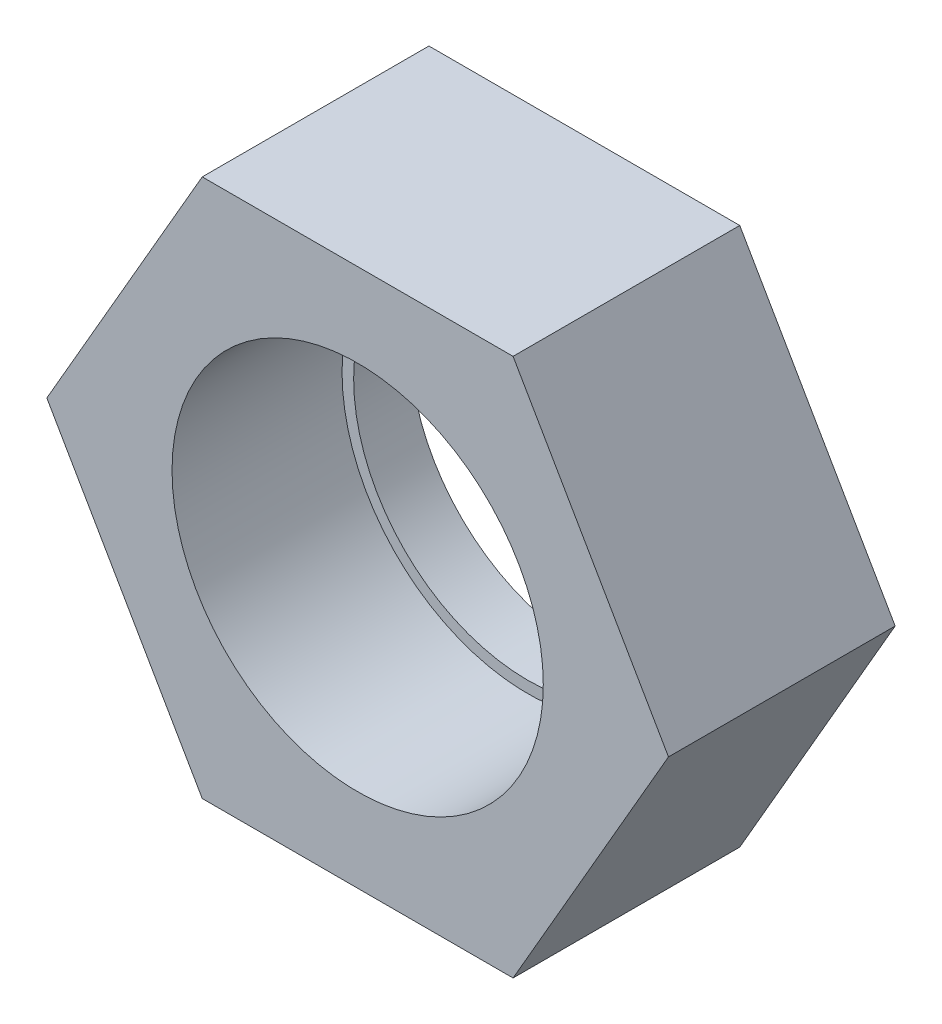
ISO-10303-21;
HEADER;
FILE_DESCRIPTION(('STEP AP214'),'2;1');
FILE_NAME('part.step','',(''),(''),'','','');
FILE_SCHEMA(('AUTOMOTIVE_DESIGN { 1 0 10303 214 1 1 1 1 }'));
ENDSEC;
DATA;
#1=APPLICATION_CONTEXT('core data for automotive mechanical design processes');
#2=APPLICATION_PROTOCOL_DEFINITION('international standard','automotive_design',2000,#1);
#3=PRODUCT_CONTEXT('',#1,'mechanical');
#4=PRODUCT('Part','Part','',(#3));
#5=PRODUCT_RELATED_PRODUCT_CATEGORY('part','',(#4));
#6=PRODUCT_DEFINITION_FORMATION('','',#4);
#7=PRODUCT_DEFINITION_CONTEXT('part definition',#1,'design');
#8=PRODUCT_DEFINITION('design','',#6,#7);
#9=PRODUCT_DEFINITION_SHAPE('','',#8);
#10=(LENGTH_UNIT() NAMED_UNIT(*) SI_UNIT(.MILLI.,.METRE.));
#11=(NAMED_UNIT(*) PLANE_ANGLE_UNIT() SI_UNIT($,.RADIAN.));
#12=(NAMED_UNIT(*) SI_UNIT($,.STERADIAN.) SOLID_ANGLE_UNIT());
#13=UNCERTAINTY_MEASURE_WITH_UNIT(LENGTH_MEASURE(1.E-05),#10,'distance_accuracy_value','');
#14=(GEOMETRIC_REPRESENTATION_CONTEXT(3) GLOBAL_UNCERTAINTY_ASSIGNED_CONTEXT((#13)) GLOBAL_UNIT_ASSIGNED_CONTEXT((#10,
#11,#12)) REPRESENTATION_CONTEXT('',''));
#15=CARTESIAN_POINT('',(0.,0.,0.));
#16=DIRECTION('',(0.,0.,1.));
#17=DIRECTION('',(1.,0.,0.));
#18=AXIS2_PLACEMENT_3D('',#15,#16,#17);
#19=CARTESIAN_POINT('',(10.4013,0.,3.175));
#20=DIRECTION('',(0.,0.,1.));
#21=DIRECTION('',(1.,0.,0.));
#22=AXIS2_PLACEMENT_3D('',#19,#20,#21);
#23=PLANE('',#22);
#24=CARTESIAN_POINT('',(0.,0.,3.175));
#25=DIRECTION('',(0.,0.,1.));
#26=DIRECTION('',(1.,0.,0.));
#27=AXIS2_PLACEMENT_3D('',#24,#25,#26);
#28=CIRCLE('',#27,9.75);
#29=CARTESIAN_POINT('',(9.75,0.,3.175));
#30=VERTEX_POINT('',#29);
#31=EDGE_CURVE('E18',#30,#30,#28,.T.);
#32=ORIENTED_EDGE('',*,*,#31,.F.);
#33=EDGE_LOOP('',(#32));
#34=FACE_BOUND('',#33,.T.);
#35=CARTESIAN_POINT('',(0.,0.,3.175));
#36=DIRECTION('',(0.,0.,1.));
#37=DIRECTION('',(1.,0.,0.));
#38=AXIS2_PLACEMENT_3D('',#35,#36,#37);
#39=CIRCLE('',#38,10.4);
#40=CARTESIAN_POINT('',(10.4,0.,3.175));
#41=VERTEX_POINT('',#40);
#42=EDGE_CURVE('E167',#41,#41,#39,.F.);
#43=ORIENTED_EDGE('',*,*,#42,.F.);
#44=EDGE_LOOP('',(#43));
#45=FACE_BOUND('',#44,.T.);
#46=ADVANCED_FACE('F14',(#34,#45),#23,.T.);
#47=CARTESIAN_POINT('',(8.70716374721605,-15.08125,12.7));
#48=DIRECTION('',(0.,0.,-1.));
#49=DIRECTION('',(-1.,0.,0.));
#50=AXIS2_PLACEMENT_3D('',#47,#48,#49);
#51=PLANE('',#50);
#52=DIRECTION('',(0.5,0.866025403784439,0.));
#53=VECTOR('',#52,1.);
#54=CARTESIAN_POINT('',(8.70716374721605,-15.08125,12.7));
#55=LINE('',#54,#53);
#56=CARTESIAN_POINT('',(8.70716374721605,-15.08125,12.7));
#57=VERTEX_POINT('',#56);
#58=CARTESIAN_POINT('',(17.4143274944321,0.,12.7));
#59=VERTEX_POINT('',#58);
#60=EDGE_CURVE('E99',#57,#59,#55,.T.);
#61=ORIENTED_EDGE('',*,*,#60,.T.);
#62=DIRECTION('',(-0.5,0.866025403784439,0.));
#63=VECTOR('',#62,1.);
#64=CARTESIAN_POINT('',(17.4143274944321,0.,12.7));
#65=LINE('',#64,#63);
#66=CARTESIAN_POINT('',(8.70716374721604,15.08125,12.7));
#67=VERTEX_POINT('',#66);
#68=EDGE_CURVE('E81',#59,#67,#65,.T.);
#69=ORIENTED_EDGE('',*,*,#68,.T.);
#70=DIRECTION('',(-1.,0.,0.));
#71=VECTOR('',#70,1.);
#72=CARTESIAN_POINT('',(8.70716374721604,15.08125,12.7));
#73=LINE('',#72,#71);
#74=CARTESIAN_POINT('',(-8.70716374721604,15.08125,12.7));
#75=VERTEX_POINT('',#74);
#76=EDGE_CURVE('E102',#67,#75,#73,.T.);
#77=ORIENTED_EDGE('',*,*,#76,.T.);
#78=DIRECTION('',(-0.5,-0.866025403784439,0.));
#79=VECTOR('',#78,1.);
#80=CARTESIAN_POINT('',(-8.70716374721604,15.08125,12.7));
#81=LINE('',#80,#79);
#82=CARTESIAN_POINT('',(-17.4143274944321,0.,12.7));
#83=VERTEX_POINT('',#82);
#84=EDGE_CURVE('E104',#75,#83,#81,.T.);
#85=ORIENTED_EDGE('',*,*,#84,.T.);
#86=DIRECTION('',(0.5,-0.866025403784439,0.));
#87=VECTOR('',#86,1.);
#88=CARTESIAN_POINT('',(-17.4143274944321,0.,12.7));
#89=LINE('',#88,#87);
#90=CARTESIAN_POINT('',(-8.70716374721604,-15.08125,12.7));
#91=VERTEX_POINT('',#90);
#92=EDGE_CURVE('E35',#83,#91,#89,.T.);
#93=ORIENTED_EDGE('',*,*,#92,.T.);
#94=DIRECTION('',(1.,0.,0.));
#95=VECTOR('',#94,1.);
#96=CARTESIAN_POINT('',(-8.70716374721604,-15.08125,12.7));
#97=LINE('',#96,#95);
#98=EDGE_CURVE('E30',#91,#57,#97,.T.);
#99=ORIENTED_EDGE('',*,*,#98,.T.);
#100=EDGE_LOOP('',(#61,#69,#77,#85,#93,#99));
#101=FACE_BOUND('',#100,.T.);
#102=CARTESIAN_POINT('',(0.,0.,12.7));
#103=DIRECTION('',(0.,0.,1.));
#104=DIRECTION('',(1.,0.,0.));
#105=AXIS2_PLACEMENT_3D('',#102,#103,#104);
#106=CIRCLE('',#105,10.4);
#107=CARTESIAN_POINT('',(10.4,0.,12.7));
#108=VERTEX_POINT('',#107);
#109=EDGE_CURVE('E169',#108,#108,#106,.T.);
#110=ORIENTED_EDGE('',*,*,#109,.F.);
#111=EDGE_LOOP('',(#110));
#112=FACE_BOUND('',#111,.T.);
#113=ADVANCED_FACE('F123',(#101,#112),#51,.F.);
#114=CARTESIAN_POINT('',(8.70716374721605,-15.08125,0.));
#115=DIRECTION('',(0.,0.,-1.));
#116=DIRECTION('',(-1.,0.,0.));
#117=AXIS2_PLACEMENT_3D('',#114,#115,#116);
#118=PLANE('',#117);
#119=CARTESIAN_POINT('',(0.,0.,0.));
#120=DIRECTION('',(0.,0.,-1.));
#121=DIRECTION('',(-1.,0.,0.));
#122=AXIS2_PLACEMENT_3D('',#119,#120,#121);
#123=CIRCLE('',#122,9.75);
#124=CARTESIAN_POINT('',(-9.75,0.,0.));
#125=VERTEX_POINT('',#124);
#126=EDGE_CURVE('E88',#125,#125,#123,.T.);
#127=ORIENTED_EDGE('',*,*,#126,.F.);
#128=EDGE_LOOP('',(#127));
#129=FACE_BOUND('',#128,.T.);
#130=DIRECTION('',(0.5,0.866025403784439,0.));
#131=VECTOR('',#130,1.);
#132=CARTESIAN_POINT('',(8.70716374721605,-15.08125,0.));
#133=LINE('',#132,#131);
#134=CARTESIAN_POINT('',(8.70716374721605,-15.08125,0.));
#135=VERTEX_POINT('',#134);
#136=CARTESIAN_POINT('',(17.4143274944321,0.,0.));
#137=VERTEX_POINT('',#136);
#138=EDGE_CURVE('E72',#135,#137,#133,.T.);
#139=ORIENTED_EDGE('',*,*,#138,.F.);
#140=DIRECTION('',(1.,0.,0.));
#141=VECTOR('',#140,1.);
#142=CARTESIAN_POINT('',(-8.70716374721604,-15.08125,0.));
#143=LINE('',#142,#141);
#144=CARTESIAN_POINT('',(-8.70716374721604,-15.08125,0.));
#145=VERTEX_POINT('',#144);
#146=EDGE_CURVE('E97',#145,#135,#143,.T.);
#147=ORIENTED_EDGE('',*,*,#146,.F.);
#148=DIRECTION('',(0.5,-0.866025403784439,0.));
#149=VECTOR('',#148,1.);
#150=CARTESIAN_POINT('',(-17.4143274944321,0.,0.));
#151=LINE('',#150,#149);
#152=CARTESIAN_POINT('',(-17.4143274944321,0.,0.));
#153=VERTEX_POINT('',#152);
#154=EDGE_CURVE('E95',#153,#145,#151,.T.);
#155=ORIENTED_EDGE('',*,*,#154,.F.);
#156=DIRECTION('',(-0.5,-0.866025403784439,0.));
#157=VECTOR('',#156,1.);
#158=CARTESIAN_POINT('',(-8.70716374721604,15.08125,0.));
#159=LINE('',#158,#157);
#160=CARTESIAN_POINT('',(-8.70716374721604,15.08125,0.));
#161=VERTEX_POINT('',#160);
#162=EDGE_CURVE('E93',#161,#153,#159,.T.);
#163=ORIENTED_EDGE('',*,*,#162,.F.);
#164=DIRECTION('',(-1.,0.,0.));
#165=VECTOR('',#164,1.);
#166=CARTESIAN_POINT('',(8.70716374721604,15.08125,0.));
#167=LINE('',#166,#165);
#168=CARTESIAN_POINT('',(8.70716374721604,15.08125,0.));
#169=VERTEX_POINT('',#168);
#170=EDGE_CURVE('E74',#169,#161,#167,.T.);
#171=ORIENTED_EDGE('',*,*,#170,.F.);
#172=DIRECTION('',(-0.5,0.866025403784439,0.));
#173=VECTOR('',#172,1.);
#174=CARTESIAN_POINT('',(17.4143274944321,0.,0.));
#175=LINE('',#174,#173);
#176=EDGE_CURVE('E68',#137,#169,#175,.T.);
#177=ORIENTED_EDGE('',*,*,#176,.F.);
#178=EDGE_LOOP('',(#139,#147,#155,#163,#171,#177));
#179=FACE_BOUND('',#178,.T.);
#180=ADVANCED_FACE('F69',(#129,#179),#118,.T.);
#181=CARTESIAN_POINT('',(8.70716374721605,-15.08125,12.7));
#182=DIRECTION('',(-0.866025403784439,0.5,0.));
#183=DIRECTION('',(-0.5,-0.866025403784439,0.));
#184=AXIS2_PLACEMENT_3D('',#181,#182,#183);
#185=PLANE('',#184);
#186=ORIENTED_EDGE('',*,*,#138,.T.);
#187=DIRECTION('',(0.,0.,-1.));
#188=VECTOR('',#187,1.);
#189=CARTESIAN_POINT('',(17.4143274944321,0.,12.7));
#190=LINE('',#189,#188);
#191=EDGE_CURVE('E9',#59,#137,#190,.T.);
#192=ORIENTED_EDGE('',*,*,#191,.F.);
#193=ORIENTED_EDGE('',*,*,#60,.F.);
#194=DIRECTION('',(0.,0.,-1.));
#195=VECTOR('',#194,1.);
#196=CARTESIAN_POINT('',(8.70716374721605,-15.08125,12.7));
#197=LINE('',#196,#195);
#198=EDGE_CURVE('E85',#57,#135,#197,.T.);
#199=ORIENTED_EDGE('',*,*,#198,.T.);
#200=EDGE_LOOP('',(#186,#192,#193,#199));
#201=FACE_BOUND('',#200,.T.);
#202=ADVANCED_FACE('F16',(#201),#185,.F.);
#203=CARTESIAN_POINT('',(17.4143274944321,0.,12.7));
#204=DIRECTION('',(-0.866025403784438,-0.5,0.));
#205=DIRECTION('',(0.5,-0.866025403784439,0.));
#206=AXIS2_PLACEMENT_3D('',#203,#204,#205);
#207=PLANE('',#206);
#208=ORIENTED_EDGE('',*,*,#176,.T.);
#209=DIRECTION('',(0.,0.,-1.));
#210=VECTOR('',#209,1.);
#211=CARTESIAN_POINT('',(8.70716374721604,15.08125,12.7));
#212=LINE('',#211,#210);
#213=EDGE_CURVE('E23',#67,#169,#212,.T.);
#214=ORIENTED_EDGE('',*,*,#213,.F.);
#215=ORIENTED_EDGE('',*,*,#68,.F.);
#216=ORIENTED_EDGE('',*,*,#191,.T.);
#217=EDGE_LOOP('',(#208,#214,#215,#216));
#218=FACE_BOUND('',#217,.T.);
#219=ADVANCED_FACE('F80',(#218),#207,.F.);
#220=CARTESIAN_POINT('',(8.70716374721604,15.08125,12.7));
#221=DIRECTION('',(0.,-1.,0.));
#222=DIRECTION('',(1.,0.,0.));
#223=AXIS2_PLACEMENT_3D('',#220,#221,#222);
#224=PLANE('',#223);
#225=ORIENTED_EDGE('',*,*,#170,.T.);
#226=DIRECTION('',(0.,0.,-1.));
#227=VECTOR('',#226,1.);
#228=CARTESIAN_POINT('',(-8.70716374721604,15.08125,12.7));
#229=LINE('',#228,#227);
#230=EDGE_CURVE('E115',#75,#161,#229,.T.);
#231=ORIENTED_EDGE('',*,*,#230,.F.);
#232=ORIENTED_EDGE('',*,*,#76,.F.);
#233=ORIENTED_EDGE('',*,*,#213,.T.);
#234=EDGE_LOOP('',(#225,#231,#232,#233));
#235=FACE_BOUND('',#234,.T.);
#236=ADVANCED_FACE('F120',(#235),#224,.F.);
#237=CARTESIAN_POINT('',(-8.70716374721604,15.08125,12.7));
#238=DIRECTION('',(0.866025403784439,-0.5,0.));
#239=DIRECTION('',(0.5,0.866025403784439,0.));
#240=AXIS2_PLACEMENT_3D('',#237,#238,#239);
#241=PLANE('',#240);
#242=ORIENTED_EDGE('',*,*,#162,.T.);
#243=DIRECTION('',(0.,0.,-1.));
#244=VECTOR('',#243,1.);
#245=CARTESIAN_POINT('',(-17.4143274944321,0.,12.7));
#246=LINE('',#245,#244);
#247=EDGE_CURVE('E112',#83,#153,#246,.T.);
#248=ORIENTED_EDGE('',*,*,#247,.F.);
#249=ORIENTED_EDGE('',*,*,#84,.F.);
#250=ORIENTED_EDGE('',*,*,#230,.T.);
#251=EDGE_LOOP('',(#242,#248,#249,#250));
#252=FACE_BOUND('',#251,.T.);
#253=ADVANCED_FACE('F127',(#252),#241,.F.);
#254=CARTESIAN_POINT('',(-17.4143274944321,0.,12.7));
#255=DIRECTION('',(0.866025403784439,0.5,0.));
#256=DIRECTION('',(-0.5,0.866025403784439,0.));
#257=AXIS2_PLACEMENT_3D('',#254,#255,#256);
#258=PLANE('',#257);
#259=ORIENTED_EDGE('',*,*,#154,.T.);
#260=DIRECTION('',(0.,0.,-1.));
#261=VECTOR('',#260,1.);
#262=CARTESIAN_POINT('',(-8.70716374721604,-15.08125,12.7));
#263=LINE('',#262,#261);
#264=EDGE_CURVE('E109',#91,#145,#263,.T.);
#265=ORIENTED_EDGE('',*,*,#264,.F.);
#266=ORIENTED_EDGE('',*,*,#92,.F.);
#267=ORIENTED_EDGE('',*,*,#247,.T.);
#268=EDGE_LOOP('',(#259,#265,#266,#267));
#269=FACE_BOUND('',#268,.T.);
#270=ADVANCED_FACE('F130',(#269),#258,.F.);
#271=CARTESIAN_POINT('',(-8.70716374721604,-15.08125,12.7));
#272=DIRECTION('',(0.,1.,0.));
#273=DIRECTION('',(0.,0.,1.));
#274=AXIS2_PLACEMENT_3D('',#271,#272,#273);
#275=PLANE('',#274);
#276=ORIENTED_EDGE('',*,*,#146,.T.);
#277=ORIENTED_EDGE('',*,*,#198,.F.);
#278=ORIENTED_EDGE('',*,*,#98,.F.);
#279=ORIENTED_EDGE('',*,*,#264,.T.);
#280=EDGE_LOOP('',(#276,#277,#278,#279));
#281=FACE_BOUND('',#280,.T.);
#282=ADVANCED_FACE('F132',(#281),#275,.F.);
#283=CARTESIAN_POINT('',(0.,0.,10.));
#284=DIRECTION('',(0.,0.,-1.));
#285=DIRECTION('',(-1.,0.,0.));
#286=AXIS2_PLACEMENT_3D('',#283,#284,#285);
#287=CYLINDRICAL_SURFACE('',#286,9.75);
#288=ORIENTED_EDGE('',*,*,#31,.T.);
#289=EDGE_LOOP('',(#288));
#290=FACE_BOUND('',#289,.T.);
#291=ORIENTED_EDGE('',*,*,#126,.T.);
#292=EDGE_LOOP('',(#291));
#293=FACE_BOUND('',#292,.T.);
#294=ADVANCED_FACE('F134',(#290,#293),#287,.F.);
#295=CARTESIAN_POINT('',(0.,0.,-30.0888470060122));
#296=DIRECTION('',(0.,0.,1.));
#297=DIRECTION('',(1.,0.,0.));
#298=AXIS2_PLACEMENT_3D('',#295,#296,#297);
#299=CYLINDRICAL_SURFACE('',#298,10.4);
#300=ORIENTED_EDGE('',*,*,#42,.T.);
#301=EDGE_LOOP('',(#300));
#302=FACE_BOUND('',#301,.T.);
#303=ORIENTED_EDGE('',*,*,#109,.T.);
#304=EDGE_LOOP('',(#303));
#305=FACE_BOUND('',#304,.T.);
#306=ADVANCED_FACE('F142',(#302,#305),#299,.F.);
#307=CLOSED_SHELL('',(#46,#113,#180,#202,#219,#236,#253,#270,#282,#294,#306));
#308=MANIFOLD_SOLID_BREP('B1',#307);
#309=ADVANCED_BREP_SHAPE_REPRESENTATION('',(#18,#308),#14);
#310=SHAPE_DEFINITION_REPRESENTATION(#9,#309);
ENDSEC;
END-ISO-10303-21;
